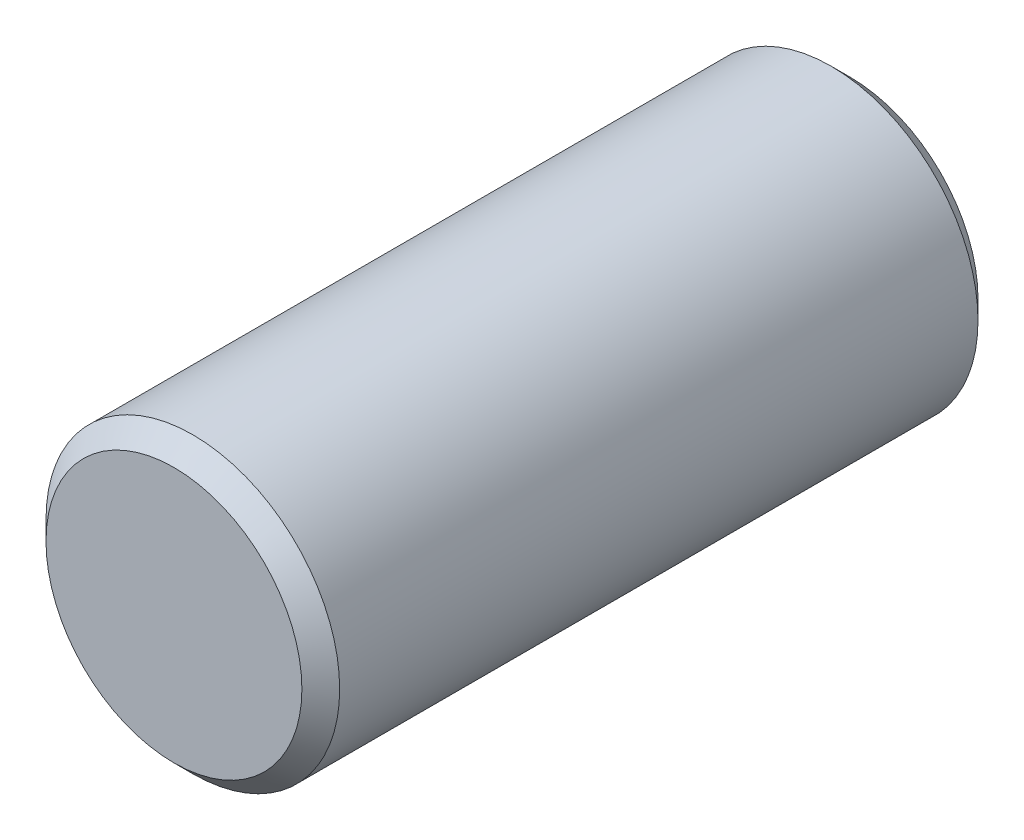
ISO-10303-21;
HEADER;
FILE_DESCRIPTION(('STEP AP214'),'2;1');
FILE_NAME('part.step','',(''),(''),'','','');
FILE_SCHEMA(('AUTOMOTIVE_DESIGN { 1 0 10303 214 1 1 1 1 }'));
ENDSEC;
DATA;
#1=APPLICATION_CONTEXT('core data for automotive mechanical design processes');
#2=APPLICATION_PROTOCOL_DEFINITION('international standard','automotive_design',2000,#1);
#3=PRODUCT_CONTEXT('',#1,'mechanical');
#4=PRODUCT('Part','Part','',(#3));
#5=PRODUCT_RELATED_PRODUCT_CATEGORY('part','',(#4));
#6=PRODUCT_DEFINITION_FORMATION('','',#4);
#7=PRODUCT_DEFINITION_CONTEXT('part definition',#1,'design');
#8=PRODUCT_DEFINITION('design','',#6,#7);
#9=PRODUCT_DEFINITION_SHAPE('','',#8);
#10=(LENGTH_UNIT() NAMED_UNIT(*) SI_UNIT(.MILLI.,.METRE.));
#11=(NAMED_UNIT(*) PLANE_ANGLE_UNIT() SI_UNIT($,.RADIAN.));
#12=(NAMED_UNIT(*) SI_UNIT($,.STERADIAN.) SOLID_ANGLE_UNIT());
#13=UNCERTAINTY_MEASURE_WITH_UNIT(LENGTH_MEASURE(1.E-05),#10,'distance_accuracy_value','');
#14=(GEOMETRIC_REPRESENTATION_CONTEXT(3) GLOBAL_UNCERTAINTY_ASSIGNED_CONTEXT((#13)) GLOBAL_UNIT_ASSIGNED_CONTEXT((#10,
#11,#12)) REPRESENTATION_CONTEXT('',''));
#15=CARTESIAN_POINT('',(0.,0.,0.));
#16=DIRECTION('',(0.,0.,1.));
#17=DIRECTION('',(1.,0.,0.));
#18=AXIS2_PLACEMENT_3D('',#15,#16,#17);
#19=CARTESIAN_POINT('',(0.,0.,4.5466));
#20=DIRECTION('',(0.,0.,-1.));
#21=DIRECTION('',(-1.,0.,0.));
#22=AXIS2_PLACEMENT_3D('',#19,#20,#21);
#23=CYLINDRICAL_SURFACE('',#22,1.97485);
#24=CARTESIAN_POINT('',(0.,0.,-4.2926));
#25=DIRECTION('',(0.,0.,1.));
#26=DIRECTION('',(1.,0.,0.));
#27=AXIS2_PLACEMENT_3D('',#24,#25,#26);
#28=CIRCLE('',#27,1.97485);
#29=CARTESIAN_POINT('',(1.97485,0.,-4.2926));
#30=VERTEX_POINT('',#29);
#31=EDGE_CURVE('E44',#30,#30,#28,.T.);
#32=ORIENTED_EDGE('',*,*,#31,.T.);
#33=EDGE_LOOP('',(#32));
#34=FACE_BOUND('',#33,.T.);
#35=CARTESIAN_POINT('',(0.,0.,4.2926));
#36=DIRECTION('',(0.,0.,1.));
#37=DIRECTION('',(1.,0.,0.));
#38=AXIS2_PLACEMENT_3D('',#35,#36,#37);
#39=CIRCLE('',#38,1.97485);
#40=CARTESIAN_POINT('',(1.97485,0.,4.2926));
#41=VERTEX_POINT('',#40);
#42=EDGE_CURVE('E48',#41,#41,#39,.F.);
#43=ORIENTED_EDGE('',*,*,#42,.T.);
#44=EDGE_LOOP('',(#43));
#45=FACE_BOUND('',#44,.T.);
#46=ADVANCED_FACE('F33',(#34,#45),#23,.T.);
#47=CARTESIAN_POINT('',(0.,0.,4.5466));
#48=DIRECTION('',(0.,0.,1.));
#49=DIRECTION('',(1.,0.,0.));
#50=AXIS2_PLACEMENT_3D('',#47,#48,#49);
#51=PLANE('',#50);
#52=CARTESIAN_POINT('',(0.,0.,4.5466));
#53=DIRECTION('',(0.,0.,1.));
#54=DIRECTION('',(1.,0.,0.));
#55=AXIS2_PLACEMENT_3D('',#52,#53,#54);
#56=CIRCLE('',#55,1.72085);
#57=CARTESIAN_POINT('',(1.72085,0.,4.5466));
#58=VERTEX_POINT('',#57);
#59=EDGE_CURVE('E10',#58,#58,#56,.T.);
#60=ORIENTED_EDGE('',*,*,#59,.T.);
#61=EDGE_LOOP('',(#60));
#62=FACE_BOUND('',#61,.T.);
#63=ADVANCED_FACE('F64',(#62),#51,.T.);
#64=CARTESIAN_POINT('',(0.,0.,-4.5466));
#65=DIRECTION('',(0.,0.,1.));
#66=DIRECTION('',(1.,0.,0.));
#67=AXIS2_PLACEMENT_3D('',#64,#65,#66);
#68=PLANE('',#67);
#69=CARTESIAN_POINT('',(0.,0.,-4.5466));
#70=DIRECTION('',(0.,0.,1.));
#71=DIRECTION('',(1.,0.,0.));
#72=AXIS2_PLACEMENT_3D('',#69,#70,#71);
#73=CIRCLE('',#72,1.72085);
#74=CARTESIAN_POINT('',(1.72085,0.,-4.5466));
#75=VERTEX_POINT('',#74);
#76=EDGE_CURVE('E40',#75,#75,#73,.F.);
#77=ORIENTED_EDGE('',*,*,#76,.T.);
#78=EDGE_LOOP('',(#77));
#79=FACE_BOUND('',#78,.T.);
#80=ADVANCED_FACE('F61',(#79),#68,.F.);
#81=CARTESIAN_POINT('',(0.,0.,-4.2926));
#82=DIRECTION('',(0.,0.,1.));
#83=DIRECTION('',(1.,0.,0.));
#84=AXIS2_PLACEMENT_3D('',#81,#82,#83);
#85=CONICAL_SURFACE('',#84,1.97485,0.78539816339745);
#86=ORIENTED_EDGE('',*,*,#76,.F.);
#87=EDGE_LOOP('',(#86));
#88=FACE_BOUND('',#87,.T.);
#89=ORIENTED_EDGE('',*,*,#31,.F.);
#90=EDGE_LOOP('',(#89));
#91=FACE_BOUND('',#90,.T.);
#92=ADVANCED_FACE('F57',(#88,#91),#85,.T.);
#93=CARTESIAN_POINT('',(0.,0.,4.5466));
#94=DIRECTION('',(0.,0.,-1.));
#95=DIRECTION('',(-1.,0.,0.));
#96=AXIS2_PLACEMENT_3D('',#93,#94,#95);
#97=CONICAL_SURFACE('',#96,1.72085,0.785398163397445);
#98=ORIENTED_EDGE('',*,*,#42,.F.);
#99=EDGE_LOOP('',(#98));
#100=FACE_BOUND('',#99,.T.);
#101=ORIENTED_EDGE('',*,*,#59,.F.);
#102=EDGE_LOOP('',(#101));
#103=FACE_BOUND('',#102,.T.);
#104=ADVANCED_FACE('F35',(#100,#103),#97,.T.);
#105=CLOSED_SHELL('',(#46,#63,#80,#92,#104));
#106=MANIFOLD_SOLID_BREP('B2',#105);
#107=ADVANCED_BREP_SHAPE_REPRESENTATION('',(#18,#106),#14);
#108=SHAPE_DEFINITION_REPRESENTATION(#9,#107);
ENDSEC;
END-ISO-10303-21;
